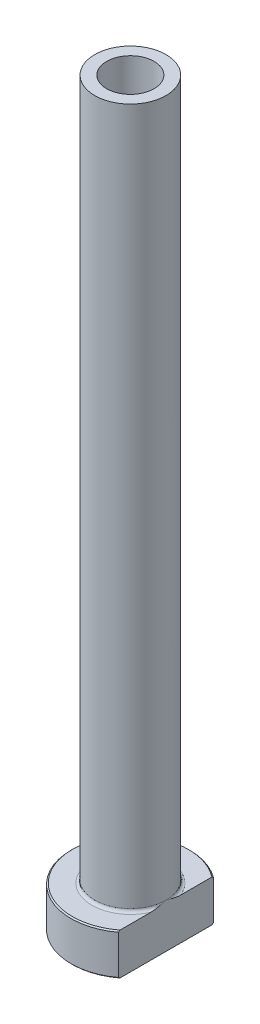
from build123d import *

# Parameters (mm, degrees)
FILLET1_R          = 0.5
CHAMFER1_SIZE      = 0.2
CUT_EXTRUDE1_DEPTH = 126.797456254
CHAMFER2_SIZE      = 0.5


with BuildPart() as part:
    # Sketch1 → Revolve1 (revolve)
    with BuildSketch(Plane.XY, mode=Mode.PRIVATE) as revolve1_sk:
        Polygon((-4, 125), (-6, 125), (-6, 7), (-10, 7), (-10, 0), (-4.25, 0), (-4.25, 68), (-4, 80), align=None)
    revolve(revolve1_sk.sketch.rotate(Axis((0, 92.187680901, 0), (0, -1, 0)), 270), axis=Axis((0, 92.187680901, 0), (0, -1, 0)))

    # Fillet1
    fillet1_edges = [part.edges().sort_by_distance(p)[0] for p in [
        (0, 7, -6),
    ]]
    fillet(fillet1_edges, radius=FILLET1_R)

    # Chamfer1
    chamfer1_edges = [part.edges().sort_by_distance(p)[0] for p in [
        (0, 0, -10),
        (0, 7, -10),
    ]]
    chamfer(chamfer1_edges, length=CHAMFER1_SIZE)

    # Sketch2 → Cut-Extrude1 (cut, through all)
    with BuildSketch(Plane.XZ):
        with BuildLine():
            Line((6, 8), (6, -8))
            ThreePointArc((6, -8), (10, 0), (6, 8))
        make_face()
    extrude(amount=-CUT_EXTRUDE1_DEPTH, mode=Mode.SUBTRACT)

    # Chamfer2
    chamfer2_edges = [part.edges().sort_by_distance(p)[0] for p in [
        (0, 0, -4.25),
    ]]
    chamfer(chamfer2_edges, length=CHAMFER2_SIZE)


solid = part.part
